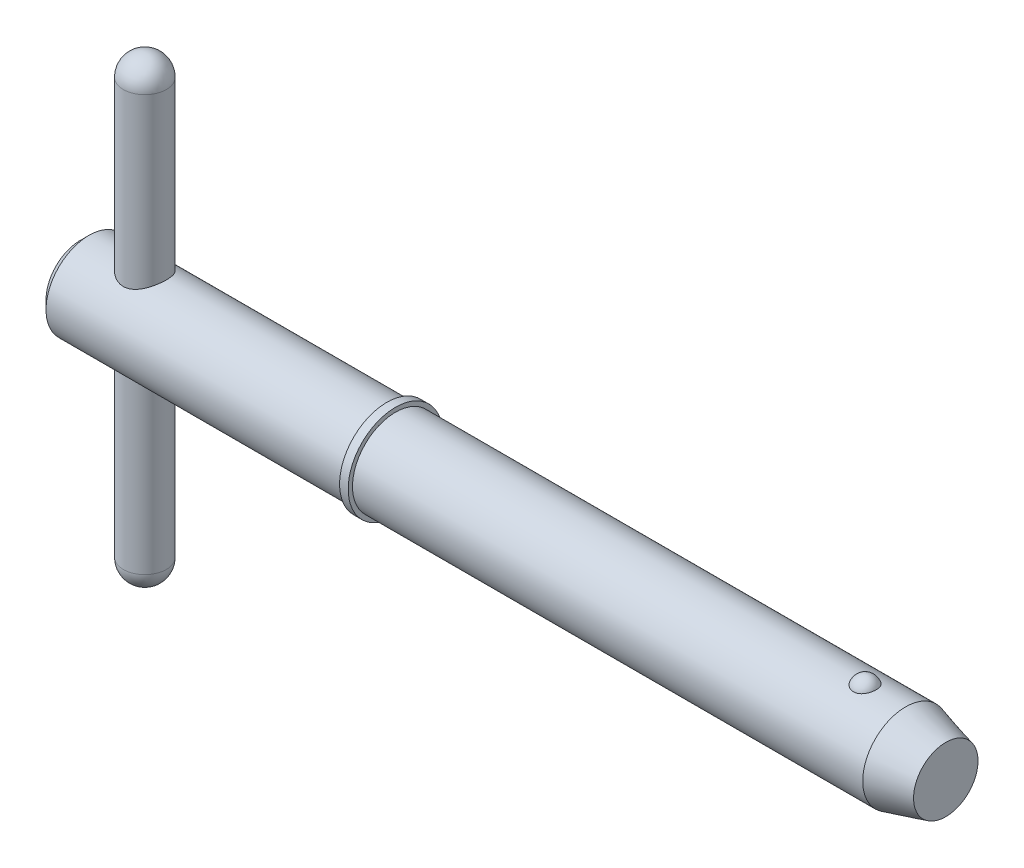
ISO-10303-21;
HEADER;
FILE_DESCRIPTION(('STEP AP214'),'2;1');
FILE_NAME('part.step','',(''),(''),'','','');
FILE_SCHEMA(('AUTOMOTIVE_DESIGN { 1 0 10303 214 1 1 1 1 }'));
ENDSEC;
DATA;
#1=APPLICATION_CONTEXT('core data for automotive mechanical design processes');
#2=APPLICATION_PROTOCOL_DEFINITION('international standard','automotive_design',2000,#1);
#3=PRODUCT_CONTEXT('',#1,'mechanical');
#4=PRODUCT('Part','Part','',(#3));
#5=PRODUCT_RELATED_PRODUCT_CATEGORY('part','',(#4));
#6=PRODUCT_DEFINITION_FORMATION('','',#4);
#7=PRODUCT_DEFINITION_CONTEXT('part definition',#1,'design');
#8=PRODUCT_DEFINITION('design','',#6,#7);
#9=PRODUCT_DEFINITION_SHAPE('','',#8);
#10=(LENGTH_UNIT() NAMED_UNIT(*) SI_UNIT(.MILLI.,.METRE.));
#11=(NAMED_UNIT(*) PLANE_ANGLE_UNIT() SI_UNIT($,.RADIAN.));
#12=(NAMED_UNIT(*) SI_UNIT($,.STERADIAN.) SOLID_ANGLE_UNIT());
#13=UNCERTAINTY_MEASURE_WITH_UNIT(LENGTH_MEASURE(1.E-05),#10,'distance_accuracy_value','');
#14=(GEOMETRIC_REPRESENTATION_CONTEXT(3) GLOBAL_UNCERTAINTY_ASSIGNED_CONTEXT((#13)) GLOBAL_UNIT_ASSIGNED_CONTEXT((#10,
#11,#12)) REPRESENTATION_CONTEXT('',''));
#15=CARTESIAN_POINT('',(0.,0.,0.));
#16=DIRECTION('',(0.,0.,1.));
#17=DIRECTION('',(1.,0.,0.));
#18=AXIS2_PLACEMENT_3D('',#15,#16,#17);
#19=CARTESIAN_POINT('',(3.57,12.7,0.));
#20=DIRECTION('',(0.,-1.,0.));
#21=DIRECTION('',(0.,0.,-1.));
#22=AXIS2_PLACEMENT_3D('',#19,#20,#21);
#23=CYLINDRICAL_SURFACE('',#22,1.19);
#24=CARTESIAN_POINT('',(3.57,-11.51,0.));
#25=DIRECTION('',(0.,-1.,0.));
#26=DIRECTION('',(0.,0.,-1.));
#27=AXIS2_PLACEMENT_3D('',#24,#25,#26);
#28=CIRCLE('',#27,1.19);
#29=CARTESIAN_POINT('',(3.57,-11.51,-1.19));
#30=VERTEX_POINT('',#29);
#31=EDGE_CURVE('P0_E10',#30,#30,#28,.F.);
#32=ORIENTED_EDGE('',*,*,#31,.T.);
#33=EDGE_LOOP('',(#32));
#34=FACE_BOUND('',#33,.T.);
#35=CARTESIAN_POINT('',(3.57,11.51,0.));
#36=DIRECTION('',(0.,-1.,0.));
#37=DIRECTION('',(0.,0.,-1.));
#38=AXIS2_PLACEMENT_3D('',#35,#36,#37);
#39=CIRCLE('',#38,1.19);
#40=CARTESIAN_POINT('',(3.57,11.51,-1.19));
#41=VERTEX_POINT('',#40);
#42=EDGE_CURVE('P0_E21',#41,#41,#39,.T.);
#43=ORIENTED_EDGE('',*,*,#42,.T.);
#44=EDGE_LOOP('',(#43));
#45=FACE_BOUND('',#44,.T.);
#46=ADVANCED_FACE('P0_F14',(#34,#45),#23,.T.);
#47=CARTESIAN_POINT('',(3.57,-11.51,0.));
#48=DIRECTION('',(0.,0.,1.));
#49=DIRECTION('',(1.,0.,0.));
#50=AXIS2_PLACEMENT_3D('',#47,#48,#49);
#51=SPHERICAL_SURFACE('',#50,1.19);
#52=CARTESIAN_POINT('',(3.57,-11.51,0.));
#53=DIRECTION('',(0.,-1.,0.));
#54=DIRECTION('',(0.,0.,-1.));
#55=AXIS2_PLACEMENT_3D('',#52,#53,#54);
#56=SPHERICAL_SURFACE('',#55,1.19);
#57=ORIENTED_EDGE('',*,*,#31,.F.);
#58=EDGE_LOOP('',(#57));
#59=FACE_BOUND('',#58,.T.);
#60=ADVANCED_FACE('P0_F29',(#59),#56,.T.);
#61=CARTESIAN_POINT('',(3.57,11.51,0.));
#62=DIRECTION('',(0.,0.,1.));
#63=DIRECTION('',(1.,0.,0.));
#64=AXIS2_PLACEMENT_3D('',#61,#62,#63);
#65=SPHERICAL_SURFACE('',#64,1.19);
#66=CARTESIAN_POINT('',(3.57,11.51,0.));
#67=DIRECTION('',(0.,-1.,0.));
#68=DIRECTION('',(0.,0.,-1.));
#69=AXIS2_PLACEMENT_3D('',#66,#67,#68);
#70=SPHERICAL_SURFACE('',#69,1.19);
#71=ORIENTED_EDGE('',*,*,#42,.F.);
#72=EDGE_LOOP('',(#71));
#73=FACE_BOUND('',#72,.T.);
#74=ADVANCED_FACE('P0_F16',(#73),#70,.T.);
#75=CLOSED_SHELL('',(#46,#60,#74));
#76=MANIFOLD_SOLID_BREP('P0_B1',#75);
#77=CARTESIAN_POINT('',(0.,0.,0.));
#78=DIRECTION('',(1.,0.,0.));
#79=DIRECTION('',(0.,0.,-1.));
#80=AXIS2_PLACEMENT_3D('',#77,#78,#79);
#81=CYLINDRICAL_SURFACE('',#80,2.38);
#82=CARTESIAN_POINT('',(45.7094297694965,0.,0.));
#83=DIRECTION('',(1.,0.,0.));
#84=DIRECTION('',(0.,0.,-1.));
#85=AXIS2_PLACEMENT_3D('',#82,#83,#84);
#86=CIRCLE('',#85,2.38);
#87=CARTESIAN_POINT('',(45.7094297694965,0.,-2.38));
#88=VERTEX_POINT('',#87);
#89=EDGE_CURVE('P1_E81',#88,#88,#86,.T.);
#90=ORIENTED_EDGE('',*,*,#89,.F.);
#91=EDGE_LOOP('',(#90));
#92=FACE_BOUND('',#91,.T.);
#93=CARTESIAN_POINT('',(17.45,0.,0.));
#94=DIRECTION('',(1.,0.,0.));
#95=DIRECTION('',(0.,0.,-1.));
#96=AXIS2_PLACEMENT_3D('',#93,#94,#95);
#97=CIRCLE('',#96,2.38);
#98=CARTESIAN_POINT('',(17.45,0.,-2.38));
#99=VERTEX_POINT('',#98);
#100=EDGE_CURVE('P1_E85',#99,#99,#97,.T.);
#101=ORIENTED_EDGE('',*,*,#100,.T.);
#102=EDGE_LOOP('',(#101));
#103=FACE_BOUND('',#102,.T.);
#104=CARTESIAN_POINT('',(43.4634492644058,2.2921568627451,0.640637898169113));
#105=CARTESIAN_POINT('',(43.4303559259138,2.29215737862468,0.640637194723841));
#106=CARTESIAN_POINT('',(43.3972546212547,2.29293179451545,0.637884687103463));
#107=CARTESIAN_POINT('',(43.3320176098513,2.29594030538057,0.626968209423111));
#108=CARTESIAN_POINT('',(43.2998823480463,2.29817506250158,0.61880178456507));
#109=CARTESIAN_POINT('',(43.2375402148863,2.3038430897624,0.597351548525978));
#110=CARTESIAN_POINT('',(43.2073305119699,2.30727454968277,0.584075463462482));
#111=CARTESIAN_POINT('',(43.1495674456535,2.31495941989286,0.552829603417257));
#112=CARTESIAN_POINT('',(43.1220141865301,2.31921286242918,0.534859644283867));
#113=CARTESIAN_POINT('',(43.0695938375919,2.32820213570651,0.494282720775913));
#114=CARTESIAN_POINT('',(43.0448050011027,2.33294694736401,0.471576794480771));
#115=CARTESIAN_POINT('',(42.9992169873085,2.34234144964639,0.422446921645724));
#116=CARTESIAN_POINT('',(42.9784185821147,2.34699112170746,0.396022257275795));
#117=CARTESIAN_POINT('',(42.9403580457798,2.35593942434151,0.338855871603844));
#118=CARTESIAN_POINT('',(42.9233051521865,2.36021170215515,0.307970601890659));
#119=CARTESIAN_POINT('',(42.8943607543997,2.3677057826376,0.243750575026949));
#120=CARTESIAN_POINT('',(42.8824701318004,2.37092740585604,0.210415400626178));
#121=CARTESIAN_POINT('',(42.8638076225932,2.37606901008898,0.1411894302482));
#122=CARTESIAN_POINT('',(42.8571956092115,2.37794816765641,0.10525240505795));
#123=CARTESIAN_POINT('',(42.8498095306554,2.38005135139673,0.032735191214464));
#124=CARTESIAN_POINT('',(42.8490358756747,2.38027526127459,-0.0038450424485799));
#125=CARTESIAN_POINT('',(42.8533628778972,2.37903842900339,-0.0769838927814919));
#126=CARTESIAN_POINT('',(42.8585202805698,2.37756141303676,-0.1135388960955));
#127=CARTESIAN_POINT('',(42.8747013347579,2.37305303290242,-0.185229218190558));
#128=CARTESIAN_POINT('',(42.8857251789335,2.37002161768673,-0.220364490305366));
#129=CARTESIAN_POINT('',(42.9133977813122,2.36273722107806,-0.28815667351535));
#130=CARTESIAN_POINT('',(42.9300389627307,2.35848588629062,-0.320816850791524));
#131=CARTESIAN_POINT('',(42.9685984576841,2.34923130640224,-0.382744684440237));
#132=CARTESIAN_POINT('',(42.990516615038,2.34422808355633,-0.412012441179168));
#133=CARTESIAN_POINT('',(43.0387549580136,2.33412555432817,-0.465830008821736));
#134=CARTESIAN_POINT('',(43.065002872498,2.32902887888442,-0.490444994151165));
#135=CARTESIAN_POINT('',(43.1214769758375,2.31926941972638,-0.534700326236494));
#136=CARTESIAN_POINT('',(43.151702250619,2.3146065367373,-0.554341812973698));
#137=CARTESIAN_POINT('',(43.2140618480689,2.30645675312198,-0.587312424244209));
#138=CARTESIAN_POINT('',(43.2460780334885,2.30293152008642,-0.600855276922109));
#139=CARTESIAN_POINT('',(43.3120795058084,2.29725171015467,-0.622220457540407));
#140=CARTESIAN_POINT('',(43.3460641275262,2.29509667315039,-0.630044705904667));
#141=CARTESIAN_POINT('',(43.413299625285,2.29249264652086,-0.639452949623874));
#142=CARTESIAN_POINT('',(43.4465087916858,2.29196755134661,-0.641315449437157));
#143=CARTESIAN_POINT('',(43.512763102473,2.29246849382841,-0.639522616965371));
#144=CARTESIAN_POINT('',(43.5458082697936,2.29349430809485,-0.635868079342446));
#145=CARTESIAN_POINT('',(43.6101025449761,2.29694059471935,-0.623301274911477));
#146=CARTESIAN_POINT('',(43.6413744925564,2.29933234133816,-0.614497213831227));
#147=CARTESIAN_POINT('',(43.7019952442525,2.30522511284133,-0.592006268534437));
#148=CARTESIAN_POINT('',(43.7313438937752,2.30872622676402,-0.578318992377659));
#149=CARTESIAN_POINT('',(43.7880369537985,2.31655795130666,-0.546112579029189));
#150=CARTESIAN_POINT('',(43.815320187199,2.32090569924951,-0.527490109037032));
#151=CARTESIAN_POINT('',(43.8664904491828,2.3299220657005,-0.486117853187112));
#152=CARTESIAN_POINT('',(43.8903767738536,2.33459075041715,-0.46336721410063));
#153=CARTESIAN_POINT('',(43.9352722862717,2.34399834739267,-0.413220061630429));
#154=CARTESIAN_POINT('',(43.9560972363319,2.34873051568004,-0.385657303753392));
#155=CARTESIAN_POINT('',(43.993056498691,2.35754932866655,-0.327455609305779));
#156=CARTESIAN_POINT('',(44.0091898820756,2.36163584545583,-0.296816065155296));
#157=CARTESIAN_POINT('',(44.0369822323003,2.36889321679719,-0.232047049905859));
#158=CARTESIAN_POINT('',(44.0484450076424,2.37202275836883,-0.197828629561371));
#159=CARTESIAN_POINT('',(44.0657523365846,2.37681926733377,-0.127900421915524));
#160=CARTESIAN_POINT('',(44.0715962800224,2.37848607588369,-0.0921904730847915));
#161=CARTESIAN_POINT('',(44.077605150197,2.38020024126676,-0.0196348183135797));
#162=CARTESIAN_POINT('',(44.0776704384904,2.38021918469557,0.0172198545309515));
#163=CARTESIAN_POINT('',(44.0718689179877,2.37856356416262,0.0904219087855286));
#164=CARTESIAN_POINT('',(44.0660018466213,2.37688892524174,0.126769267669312));
#165=CARTESIAN_POINT('',(44.048425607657,2.37201688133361,0.19802859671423));
#166=CARTESIAN_POINT('',(44.0366998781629,2.36881516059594,0.232936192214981));
#167=CARTESIAN_POINT('',(44.0076354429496,2.36123444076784,0.300196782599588));
#168=CARTESIAN_POINT('',(43.9902967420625,2.3568554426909,0.332549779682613));
#169=CARTESIAN_POINT('',(43.9505350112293,2.34744667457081,0.39349541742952));
#170=CARTESIAN_POINT('',(43.9281528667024,2.34242227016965,0.422115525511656));
#171=CARTESIAN_POINT('',(43.8787391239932,2.33227293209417,0.475004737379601));
#172=CARTESIAN_POINT('',(43.8517076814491,2.32714800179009,0.499273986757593));
#173=CARTESIAN_POINT('',(43.7944988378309,2.31755359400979,0.542046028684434));
#174=CARTESIAN_POINT('',(43.7644297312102,2.3130698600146,0.560690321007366));
#175=CARTESIAN_POINT('',(43.7013869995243,2.30514125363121,0.592447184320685));
#176=CARTESIAN_POINT('',(43.6684158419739,2.30169550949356,0.605564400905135));
#177=CARTESIAN_POINT('',(43.6068424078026,2.29677744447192,0.623927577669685));
#178=CARTESIAN_POINT('',(43.5785555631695,2.295058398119,0.630178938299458));
#179=CARTESIAN_POINT('',(43.5213308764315,2.29274795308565,0.638534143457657));
#180=CARTESIAN_POINT('',(43.4923931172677,2.29215641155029,0.640638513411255));
#181=CARTESIAN_POINT('',(43.4634492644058,2.2921568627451,0.640637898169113));
#182=B_SPLINE_CURVE_WITH_KNOTS('',3,(#104,#105,#106,#107,#108,#109,#110,#111,#112,#113,#114,
#115,#116,#117,#118,#119,#120,#121,#122,#123,#124,#125,#126,#127,#128,#129,#130,#131,#132,#133,
#134,#135,#136,#137,#138,#139,#140,#141,#142,#143,#144,#145,#146,#147,#148,#149,#150,#151,#152,
#153,#154,#155,#156,#157,#158,#159,#160,#161,#162,#163,#164,#165,#166,#167,#168,#169,#170,#171,
#172,#173,#174,#175,#176,#177,#178,#179,#180,#181),.UNSPECIFIED.,.T.,.F.,(4,2,2,2,2,2,2,2,2,2,2,
2,2,2,2,2,2,2,2,2,2,2,2,2,2,2,2,2,2,2,2,2,2,2,2,2,2,2,4),(0.,0.0991724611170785,
0.198389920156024,0.29745794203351,0.396529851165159,0.497927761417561,0.599345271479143,
0.705475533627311,0.811623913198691,0.920876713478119,1.03013718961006,1.14045177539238,
1.25076998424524,1.36093998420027,1.47110672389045,1.57959248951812,1.68805336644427,
1.79234266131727,1.89659691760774,1.99590391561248,2.09519661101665,2.19247425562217,
2.28975970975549,2.38926978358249,2.48880044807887,2.59293588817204,2.69709193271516,
2.80525821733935,2.91343624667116,3.02347917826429,3.13352698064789,3.24388765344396,
3.35424823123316,3.46374443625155,3.5732369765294,3.67968690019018,3.78604717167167,
3.87279565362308,3.9595331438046),.UNSPECIFIED.);
#183=CARTESIAN_POINT('',(43.4634492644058,2.2921568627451,0.640637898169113));
#184=VERTEX_POINT('',#183);
#185=EDGE_CURVE('P1_E35',#184,#184,#182,.T.);
#186=ORIENTED_EDGE('',*,*,#185,.T.);
#187=EDGE_LOOP('',(#186));
#188=FACE_BOUND('',#187,.T.);
#189=ADVANCED_FACE('P1_F13',(#92,#103,#188),#81,.T.);
#190=CARTESIAN_POINT('',(0.,0.,0.));
#191=DIRECTION('',(-1.,0.,0.));
#192=DIRECTION('',(0.,0.,1.));
#193=AXIS2_PLACEMENT_3D('',#190,#191,#192);
#194=PLANE('',#193);
#195=CARTESIAN_POINT('',(0.,0.,0.));
#196=DIRECTION('',(1.,0.,0.));
#197=DIRECTION('',(0.,0.,-1.));
#198=AXIS2_PLACEMENT_3D('',#195,#196,#197);
#199=CIRCLE('',#198,1.904);
#200=CARTESIAN_POINT('',(0.,0.,-1.904));
#201=VERTEX_POINT('',#200);
#202=EDGE_CURVE('P1_E9',#201,#201,#199,.T.);
#203=ORIENTED_EDGE('',*,*,#202,.F.);
#204=EDGE_LOOP('',(#203));
#205=FACE_BOUND('',#204,.T.);
#206=ADVANCED_FACE('P1_F15',(#205),#194,.T.);
#207=CARTESIAN_POINT('',(0.475999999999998,0.,0.));
#208=DIRECTION('',(1.,0.,0.));
#209=DIRECTION('',(0.,0.,-1.));
#210=AXIS2_PLACEMENT_3D('',#207,#208,#209);
#211=CONICAL_SURFACE('',#210,2.38,0.78539816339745);
#212=ORIENTED_EDGE('',*,*,#202,.T.);
#213=EDGE_LOOP('',(#212));
#214=FACE_BOUND('',#213,.T.);
#215=CARTESIAN_POINT('',(0.475999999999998,0.,0.));
#216=DIRECTION('',(1.,0.,0.));
#217=DIRECTION('',(0.,0.,-1.));
#218=AXIS2_PLACEMENT_3D('',#215,#216,#217);
#219=CIRCLE('',#218,2.38);
#220=CARTESIAN_POINT('',(0.475999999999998,0.,-2.38));
#221=VERTEX_POINT('',#220);
#222=EDGE_CURVE('P1_E26',#221,#221,#219,.T.);
#223=ORIENTED_EDGE('',*,*,#222,.F.);
#224=EDGE_LOOP('',(#223));
#225=FACE_BOUND('',#224,.T.);
#226=ADVANCED_FACE('P1_F77',(#214,#225),#211,.T.);
#227=CARTESIAN_POINT('',(0.,0.,0.));
#228=DIRECTION('',(1.,0.,0.));
#229=DIRECTION('',(0.,0.,-1.));
#230=AXIS2_PLACEMENT_3D('',#227,#228,#229);
#231=CYLINDRICAL_SURFACE('',#230,2.38);
#232=CARTESIAN_POINT('',(3.57,-2.06114046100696,1.19));
#233=CARTESIAN_POINT('',(3.50799170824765,-2.06114586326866,1.18999567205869));
#234=CARTESIAN_POINT('',(3.4459051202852,-2.0639812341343,1.18512096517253));
#235=CARTESIAN_POINT('',(3.32363755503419,-2.07491216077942,1.16587061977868));
#236=CARTESIAN_POINT('',(3.26346086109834,-2.08301876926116,1.15147501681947));
#237=CARTESIAN_POINT('',(3.14701251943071,-2.10331722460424,1.11395893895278));
#238=CARTESIAN_POINT('',(3.09072196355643,-2.1154873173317,1.09088484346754));
#239=CARTESIAN_POINT('',(2.9828251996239,-2.14250771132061,1.03680835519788));
#240=CARTESIAN_POINT('',(2.93121924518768,-2.15735815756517,1.00580553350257));
#241=CARTESIAN_POINT('',(2.82945618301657,-2.18956274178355,0.933753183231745));
#242=CARTESIAN_POINT('',(2.77976962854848,-2.20702235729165,0.892085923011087));
#243=CARTESIAN_POINT('',(2.68772401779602,-2.2416265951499,0.801172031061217));
#244=CARTESIAN_POINT('',(2.64536861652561,-2.25877105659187,0.751921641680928));
#245=CARTESIAN_POINT('',(2.56639309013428,-2.29219557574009,0.64318258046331));
#246=CARTESIAN_POINT('',(2.53035201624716,-2.30833946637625,0.583227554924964));
#247=CARTESIAN_POINT('',(2.46908238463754,-2.3365739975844,0.45714686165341));
#248=CARTESIAN_POINT('',(2.44384700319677,-2.34866719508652,0.391025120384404));
#249=CARTESIAN_POINT('',(2.40676945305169,-2.36667748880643,0.259473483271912));
#250=CARTESIAN_POINT('',(2.39410206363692,-2.37297281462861,0.194329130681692));
#251=CARTESIAN_POINT('',(2.3798023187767,-2.3800902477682,0.0625590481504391));
#252=CARTESIAN_POINT('',(2.37816328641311,-2.38091566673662,-0.00406576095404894));
#253=CARTESIAN_POINT('',(2.38564854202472,-2.37717948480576,-0.130700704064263));
#254=CARTESIAN_POINT('',(2.39384923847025,-2.37308010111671,-0.190782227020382));
#255=CARTESIAN_POINT('',(2.41912820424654,-2.360653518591,-0.308583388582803));
#256=CARTESIAN_POINT('',(2.43620713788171,-2.35232600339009,-0.366302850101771));
#257=CARTESIAN_POINT('',(2.47886825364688,-2.33206184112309,-0.478748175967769));
#258=CARTESIAN_POINT('',(2.50456481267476,-2.32007685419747,-0.533421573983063));
#259=CARTESIAN_POINT('',(2.56357346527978,-2.29357798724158,-0.637812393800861));
#260=CARTESIAN_POINT('',(2.5968882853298,-2.27906320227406,-0.687528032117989));
#261=CARTESIAN_POINT('',(2.67380546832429,-2.24724829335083,-0.785606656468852));
#262=CARTESIAN_POINT('',(2.71808260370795,-2.22981457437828,-0.833397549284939));
#263=CARTESIAN_POINT('',(2.81386177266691,-2.19500665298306,-0.921184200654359));
#264=CARTESIAN_POINT('',(2.86536931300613,-2.17763250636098,-0.961173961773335));
#265=CARTESIAN_POINT('',(2.97815134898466,-2.14371545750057,-1.03471134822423));
#266=CARTESIAN_POINT('',(3.03983836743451,-2.12729540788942,-1.06768860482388));
#267=CARTESIAN_POINT('',(3.16889582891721,-2.09886785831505,-1.12254974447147));
#268=CARTESIAN_POINT('',(3.2362602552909,-2.0868557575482,-1.14444520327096));
#269=CARTESIAN_POINT('',(3.36914526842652,-2.06994116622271,-1.1747444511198));
#270=CARTESIAN_POINT('',(3.43438893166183,-2.06455070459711,-1.18407989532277));
#271=CARTESIAN_POINT('',(3.56571759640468,-2.06010324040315,-1.1918051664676));
#272=CARTESIAN_POINT('',(3.63180197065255,-2.06104176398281,-1.19020272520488));
#273=CARTESIAN_POINT('',(3.75522816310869,-2.06862860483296,-1.17695289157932));
#274=CARTESIAN_POINT('',(3.81273554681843,-2.07464109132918,-1.16642350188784));
#275=CARTESIAN_POINT('',(3.92505766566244,-2.09075885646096,-1.1372785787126));
#276=CARTESIAN_POINT('',(3.97987152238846,-2.1008654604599,-1.1186604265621));
#277=CARTESIAN_POINT('',(4.08813948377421,-2.12458104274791,-1.07296063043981));
#278=CARTESIAN_POINT('',(4.14141303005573,-2.13833055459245,-1.04552693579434));
#279=CARTESIAN_POINT('',(4.2429084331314,-2.16765782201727,-0.983281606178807));
#280=CARTESIAN_POINT('',(4.29112767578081,-2.18323651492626,-0.948466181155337));
#281=CARTESIAN_POINT('',(4.38750473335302,-2.2168271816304,-0.867316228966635));
#282=CARTESIAN_POINT('',(4.43488860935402,-2.23489833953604,-0.82008287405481));
#283=CARTESIAN_POINT('',(4.52130056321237,-2.26973739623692,-0.718051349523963));
#284=CARTESIAN_POINT('',(4.56032581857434,-2.28650485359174,-0.663250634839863));
#285=CARTESIAN_POINT('',(4.62978273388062,-2.31742220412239,-0.545657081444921));
#286=CARTESIAN_POINT('',(4.65996041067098,-2.33149133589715,-0.482691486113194));
#287=CARTESIAN_POINT('',(4.7089941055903,-2.35481192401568,-0.351671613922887));
#288=CARTESIAN_POINT('',(4.7278600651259,-2.36406760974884,-0.283621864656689));
#289=CARTESIAN_POINT('',(4.75210859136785,-2.3760433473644,-0.151105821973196));
#290=CARTESIAN_POINT('',(4.75856947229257,-2.37928514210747,-0.0868836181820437));
#291=CARTESIAN_POINT('',(4.76100348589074,-2.38050135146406,0.0417999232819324));
#292=CARTESIAN_POINT('',(4.75698028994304,-2.37847760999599,0.106261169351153));
#293=CARTESIAN_POINT('',(4.73927447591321,-2.36969422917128,0.229120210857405));
#294=CARTESIAN_POINT('',(4.72624582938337,-2.36325544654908,0.287637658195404));
#295=CARTESIAN_POINT('',(4.69178087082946,-2.34658591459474,0.401560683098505));
#296=CARTESIAN_POINT('',(4.67034335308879,-2.33635462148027,0.456965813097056));
#297=CARTESIAN_POINT('',(4.61871480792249,-2.31247857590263,0.565753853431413));
#298=CARTESIAN_POINT('',(4.58818860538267,-2.29870654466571,0.618948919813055));
#299=CARTESIAN_POINT('',(4.51967006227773,-2.26918878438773,0.719681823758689));
#300=CARTESIAN_POINT('',(4.48167429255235,-2.25344215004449,0.76721704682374));
#301=CARTESIAN_POINT('',(4.39491140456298,-2.21969046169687,0.860267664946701));
#302=CARTESIAN_POINT('',(4.34544863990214,-2.20161660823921,0.905111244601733));
#303=CARTESIAN_POINT('',(4.23943364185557,-2.16655060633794,0.986109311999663));
#304=CARTESIAN_POINT('',(4.18287520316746,-2.1495594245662,1.02225611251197));
#305=CARTESIAN_POINT('',(4.06190239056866,-2.1181953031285,1.08579298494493));
#306=CARTESIAN_POINT('',(3.9972962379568,-2.10392207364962,1.11287022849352));
#307=CARTESIAN_POINT('',(3.86353443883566,-2.08090726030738,1.15534566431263));
#308=CARTESIAN_POINT('',(3.7943948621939,-2.07214719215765,1.17078291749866));
#309=CARTESIAN_POINT('',(3.69875162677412,-2.06499834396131,1.18329673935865));
#310=CARTESIAN_POINT('',(3.67309220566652,-2.06355673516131,1.18580656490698));
#311=CARTESIAN_POINT('',(3.62162638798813,-2.06162663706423,1.18915915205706));
#312=CARTESIAN_POINT('',(3.59581998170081,-2.0611382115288,1.19000180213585));
#313=CARTESIAN_POINT('',(3.57,-2.06114046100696,1.19));
#314=B_SPLINE_CURVE_WITH_KNOTS('',3,(#232,#233,#234,#235,#236,#237,#238,#239,#240,#241,#242,
#243,#244,#245,#246,#247,#248,#249,#250,#251,#252,#253,#254,#255,#256,#257,#258,#259,#260,#261,
#262,#263,#264,#265,#266,#267,#268,#269,#270,#271,#272,#273,#274,#275,#276,#277,#278,#279,#280,
#281,#282,#283,#284,#285,#286,#287,#288,#289,#290,#291,#292,#293,#294,#295,#296,#297,#298,#299,
#300,#301,#302,#303,#304,#305,#306,#307,#308,#309,#310,#311,#312,#313),.UNSPECIFIED.,.T.,.F.,(4,
2,2,2,2,2,2,2,2,2,2,2,2,2,2,2,2,2,2,2,2,2,2,2,2,2,2,2,2,2,2,2,2,2,2,2,2,2,2,2,4),(0.,
0.185916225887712,0.372223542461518,0.557549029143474,0.742884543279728,0.943506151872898,
1.14422749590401,1.35847891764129,1.5725948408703,1.77147547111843,1.97023568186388,
2.15171156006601,2.33320101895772,2.51720146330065,2.70126786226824,2.902733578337,
3.10435357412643,3.31877721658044,3.53297641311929,3.73020126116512,3.92728670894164,
4.1028127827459,4.27839572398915,4.46211082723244,4.64592048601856,4.8529002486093,
5.0599497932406,5.27246375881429,5.48479067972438,5.67763601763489,5.87041383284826,
6.05048865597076,6.23058930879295,6.41839293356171,6.60628297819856,6.8128718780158,
7.01964271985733,7.2329479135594,7.44553408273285,7.52294360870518,7.60035831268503),.UNSPECIFIED.);
#315=CARTESIAN_POINT('',(3.57,-2.06114046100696,1.19));
#316=VERTEX_POINT('',#315);
#317=EDGE_CURVE('P1_E17',#316,#316,#314,.T.);
#318=ORIENTED_EDGE('',*,*,#317,.F.);
#319=EDGE_LOOP('',(#318));
#320=FACE_BOUND('',#319,.T.);
#321=CARTESIAN_POINT('',(3.57,2.06114046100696,1.19));
#322=CARTESIAN_POINT('',(3.63200829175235,2.06114586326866,1.18999567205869));
#323=CARTESIAN_POINT('',(3.6940948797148,2.0639812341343,1.18512096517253));
#324=CARTESIAN_POINT('',(3.81636244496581,2.07491216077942,1.16587061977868));
#325=CARTESIAN_POINT('',(3.87653913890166,2.08301876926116,1.15147501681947));
#326=CARTESIAN_POINT('',(3.99298748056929,2.10331722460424,1.11395893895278));
#327=CARTESIAN_POINT('',(4.04927803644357,2.1154873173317,1.09088484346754));
#328=CARTESIAN_POINT('',(4.1571748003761,2.14250771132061,1.03680835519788));
#329=CARTESIAN_POINT('',(4.20878075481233,2.15735815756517,1.00580553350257));
#330=CARTESIAN_POINT('',(4.31054381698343,2.18956274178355,0.933753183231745));
#331=CARTESIAN_POINT('',(4.36023037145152,2.20702235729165,0.892085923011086));
#332=CARTESIAN_POINT('',(4.45227598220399,2.2416265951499,0.801172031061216));
#333=CARTESIAN_POINT('',(4.49463138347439,2.25877105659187,0.751921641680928));
#334=CARTESIAN_POINT('',(4.57360690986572,2.29219557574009,0.643182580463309));
#335=CARTESIAN_POINT('',(4.60964798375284,2.30833946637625,0.583227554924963));
#336=CARTESIAN_POINT('',(4.67091761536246,2.3365739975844,0.457146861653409));
#337=CARTESIAN_POINT('',(4.69615299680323,2.34866719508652,0.391025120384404));
#338=CARTESIAN_POINT('',(4.73323054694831,2.36667748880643,0.259473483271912));
#339=CARTESIAN_POINT('',(4.74589793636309,2.37297281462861,0.194329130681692));
#340=CARTESIAN_POINT('',(4.7601976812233,2.3800902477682,0.0625590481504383));
#341=CARTESIAN_POINT('',(4.76183671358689,2.38091566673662,-0.00406576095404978));
#342=CARTESIAN_POINT('',(4.75435145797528,2.37717948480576,-0.130700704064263));
#343=CARTESIAN_POINT('',(4.74615076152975,2.37308010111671,-0.190782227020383));
#344=CARTESIAN_POINT('',(4.72087179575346,2.360653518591,-0.308583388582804));
#345=CARTESIAN_POINT('',(4.70379286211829,2.35232600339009,-0.366302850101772));
#346=CARTESIAN_POINT('',(4.66113174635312,2.33206184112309,-0.478748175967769));
#347=CARTESIAN_POINT('',(4.63543518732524,2.32007685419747,-0.533421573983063));
#348=CARTESIAN_POINT('',(4.57642653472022,2.29357798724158,-0.637812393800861));
#349=CARTESIAN_POINT('',(4.5431117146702,2.27906320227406,-0.687528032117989));
#350=CARTESIAN_POINT('',(4.46619453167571,2.24724829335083,-0.785606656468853));
#351=CARTESIAN_POINT('',(4.42191739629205,2.22981457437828,-0.83339754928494));
#352=CARTESIAN_POINT('',(4.32613822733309,2.19500665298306,-0.921184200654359));
#353=CARTESIAN_POINT('',(4.27463068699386,2.17763250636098,-0.961173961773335));
#354=CARTESIAN_POINT('',(4.16184865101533,2.14371545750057,-1.03471134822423));
#355=CARTESIAN_POINT('',(4.10016163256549,2.12729540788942,-1.06768860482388));
#356=CARTESIAN_POINT('',(3.97110417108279,2.09886785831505,-1.12254974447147));
#357=CARTESIAN_POINT('',(3.9037397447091,2.0868557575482,-1.14444520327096));
#358=CARTESIAN_POINT('',(3.77085473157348,2.06994116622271,-1.1747444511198));
#359=CARTESIAN_POINT('',(3.70561106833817,2.06455070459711,-1.18407989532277));
#360=CARTESIAN_POINT('',(3.57428240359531,2.06010324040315,-1.1918051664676));
#361=CARTESIAN_POINT('',(3.50819802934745,2.06104176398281,-1.19020272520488));
#362=CARTESIAN_POINT('',(3.38477183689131,2.06862860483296,-1.17695289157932));
#363=CARTESIAN_POINT('',(3.32726445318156,2.07464109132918,-1.16642350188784));
#364=CARTESIAN_POINT('',(3.21494233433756,2.09075885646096,-1.1372785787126));
#365=CARTESIAN_POINT('',(3.16012847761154,2.1008654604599,-1.1186604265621));
#366=CARTESIAN_POINT('',(3.05186051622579,2.12458104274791,-1.07296063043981));
#367=CARTESIAN_POINT('',(2.99858696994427,2.13833055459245,-1.04552693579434));
#368=CARTESIAN_POINT('',(2.8970915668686,2.16765782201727,-0.983281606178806));
#369=CARTESIAN_POINT('',(2.84887232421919,2.18323651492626,-0.948466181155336));
#370=CARTESIAN_POINT('',(2.75249526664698,2.2168271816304,-0.867316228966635));
#371=CARTESIAN_POINT('',(2.70511139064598,2.23489833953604,-0.820082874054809));
#372=CARTESIAN_POINT('',(2.61869943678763,2.26973739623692,-0.718051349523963));
#373=CARTESIAN_POINT('',(2.57967418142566,2.28650485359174,-0.663250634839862));
#374=CARTESIAN_POINT('',(2.51021726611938,2.31742220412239,-0.54565708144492));
#375=CARTESIAN_POINT('',(2.48003958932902,2.33149133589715,-0.482691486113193));
#376=CARTESIAN_POINT('',(2.4310058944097,2.35481192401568,-0.351671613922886));
#377=CARTESIAN_POINT('',(2.4121399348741,2.36406760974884,-0.283621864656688));
#378=CARTESIAN_POINT('',(2.38789140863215,2.3760433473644,-0.151105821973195));
#379=CARTESIAN_POINT('',(2.38143052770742,2.37928514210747,-0.0868836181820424));
#380=CARTESIAN_POINT('',(2.37899651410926,2.38050135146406,0.0417999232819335));
#381=CARTESIAN_POINT('',(2.38301971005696,2.37847760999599,0.106261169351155));
#382=CARTESIAN_POINT('',(2.40072552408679,2.36969422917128,0.229120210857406));
#383=CARTESIAN_POINT('',(2.41375417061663,2.36325544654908,0.287637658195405));
#384=CARTESIAN_POINT('',(2.44821912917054,2.34658591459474,0.401560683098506));
#385=CARTESIAN_POINT('',(2.46965664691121,2.33635462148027,0.456965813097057));
#386=CARTESIAN_POINT('',(2.52128519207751,2.31247857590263,0.565753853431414));
#387=CARTESIAN_POINT('',(2.55181139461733,2.29870654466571,0.618948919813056));
#388=CARTESIAN_POINT('',(2.62032993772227,2.26918878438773,0.719681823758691));
#389=CARTESIAN_POINT('',(2.65832570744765,2.25344215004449,0.767217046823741));
#390=CARTESIAN_POINT('',(2.74508859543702,2.21969046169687,0.860267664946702));
#391=CARTESIAN_POINT('',(2.79455136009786,2.20161660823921,0.905111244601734));
#392=CARTESIAN_POINT('',(2.90056635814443,2.16655060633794,0.986109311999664));
#393=CARTESIAN_POINT('',(2.95712479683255,2.1495594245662,1.02225611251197));
#394=CARTESIAN_POINT('',(3.07809760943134,2.1181953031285,1.08579298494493));
#395=CARTESIAN_POINT('',(3.1427037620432,2.10392207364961,1.11287022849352));
#396=CARTESIAN_POINT('',(3.27646556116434,2.08090726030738,1.15534566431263));
#397=CARTESIAN_POINT('',(3.3456051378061,2.07214719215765,1.17078291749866));
#398=CARTESIAN_POINT('',(3.44124837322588,2.06499834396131,1.18329673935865));
#399=CARTESIAN_POINT('',(3.46690779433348,2.06355673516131,1.18580656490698));
#400=CARTESIAN_POINT('',(3.51837361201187,2.06162663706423,1.18915915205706));
#401=CARTESIAN_POINT('',(3.54418001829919,2.0611382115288,1.19000180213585));
#402=CARTESIAN_POINT('',(3.57,2.06114046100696,1.19));
#403=B_SPLINE_CURVE_WITH_KNOTS('',3,(#321,#322,#323,#324,#325,#326,#327,#328,#329,#330,#331,
#332,#333,#334,#335,#336,#337,#338,#339,#340,#341,#342,#343,#344,#345,#346,#347,#348,#349,#350,
#351,#352,#353,#354,#355,#356,#357,#358,#359,#360,#361,#362,#363,#364,#365,#366,#367,#368,#369,
#370,#371,#372,#373,#374,#375,#376,#377,#378,#379,#380,#381,#382,#383,#384,#385,#386,#387,#388,
#389,#390,#391,#392,#393,#394,#395,#396,#397,#398,#399,#400,#401,#402),.UNSPECIFIED.,.T.,.F.,(4,
2,2,2,2,2,2,2,2,2,2,2,2,2,2,2,2,2,2,2,2,2,2,2,2,2,2,2,2,2,2,2,2,2,2,2,2,2,2,2,4),(0.,
0.185916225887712,0.372223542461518,0.557549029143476,0.74288454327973,0.9435061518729,
1.14422749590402,1.35847891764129,1.5725948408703,1.77147547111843,1.97023568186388,
2.15171156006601,2.33320101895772,2.51720146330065,2.70126786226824,2.902733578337,
3.10435357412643,3.31877721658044,3.53297641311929,3.73020126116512,3.92728670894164,
4.1028127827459,4.27839572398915,4.46211082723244,4.64592048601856,4.8529002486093,
5.05994979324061,5.27246375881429,5.48479067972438,5.67763601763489,5.87041383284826,
6.05048865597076,6.23058930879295,6.41839293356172,6.60628297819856,6.8128718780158,
7.01964271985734,7.2329479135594,7.44553408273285,7.52294360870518,7.60035831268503),.UNSPECIFIED.);
#404=CARTESIAN_POINT('',(3.57,2.06114046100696,1.19));
#405=VERTEX_POINT('',#404);
#406=EDGE_CURVE('P1_E43',#405,#405,#403,.T.);
#407=ORIENTED_EDGE('',*,*,#406,.F.);
#408=EDGE_LOOP('',(#407));
#409=FACE_BOUND('',#408,.T.);
#410=ORIENTED_EDGE('',*,*,#222,.T.);
#411=EDGE_LOOP('',(#410));
#412=FACE_BOUND('',#411,.T.);
#413=CARTESIAN_POINT('',(16.974,0.,0.));
#414=DIRECTION('',(1.,0.,0.));
#415=DIRECTION('',(0.,0.,-1.));
#416=AXIS2_PLACEMENT_3D('',#413,#414,#415);
#417=CIRCLE('',#416,2.38);
#418=CARTESIAN_POINT('',(16.974,0.,-2.38));
#419=VERTEX_POINT('',#418);
#420=EDGE_CURVE('P1_E31',#419,#419,#417,.T.);
#421=ORIENTED_EDGE('',*,*,#420,.F.);
#422=EDGE_LOOP('',(#421));
#423=FACE_BOUND('',#422,.T.);
#424=ADVANCED_FACE('P1_F103',(#320,#409,#412,#423),#231,.T.);
#425=CARTESIAN_POINT('',(16.974,2.38,0.));
#426=DIRECTION('',(-1.,0.,0.));
#427=DIRECTION('',(0.,0.,1.));
#428=AXIS2_PLACEMENT_3D('',#425,#426,#427);
#429=PLANE('',#428);
#430=ORIENTED_EDGE('',*,*,#420,.T.);
#431=EDGE_LOOP('',(#430));
#432=FACE_BOUND('',#431,.T.);
#433=CARTESIAN_POINT('',(16.974,0.,0.));
#434=DIRECTION('',(1.,0.,0.));
#435=DIRECTION('',(0.,0.,-1.));
#436=AXIS2_PLACEMENT_3D('',#433,#434,#435);
#437=CIRCLE('',#436,2.618);
#438=CARTESIAN_POINT('',(16.974,0.,-2.618));
#439=VERTEX_POINT('',#438);
#440=EDGE_CURVE('P1_E91',#439,#439,#437,.T.);
#441=ORIENTED_EDGE('',*,*,#440,.F.);
#442=EDGE_LOOP('',(#441));
#443=FACE_BOUND('',#442,.T.);
#444=ADVANCED_FACE('P1_F100',(#432,#443),#429,.T.);
#445=CARTESIAN_POINT('',(0.,0.,0.));
#446=DIRECTION('',(1.,0.,0.));
#447=DIRECTION('',(0.,0.,-1.));
#448=AXIS2_PLACEMENT_3D('',#445,#446,#447);
#449=CYLINDRICAL_SURFACE('',#448,2.618);
#450=ORIENTED_EDGE('',*,*,#440,.T.);
#451=EDGE_LOOP('',(#450));
#452=FACE_BOUND('',#451,.T.);
#453=CARTESIAN_POINT('',(17.45,0.,0.));
#454=DIRECTION('',(1.,0.,0.));
#455=DIRECTION('',(0.,0.,-1.));
#456=AXIS2_PLACEMENT_3D('',#453,#454,#455);
#457=CIRCLE('',#456,2.618);
#458=CARTESIAN_POINT('',(17.45,0.,-2.618));
#459=VERTEX_POINT('',#458);
#460=EDGE_CURVE('P1_E88',#459,#459,#457,.T.);
#461=ORIENTED_EDGE('',*,*,#460,.F.);
#462=EDGE_LOOP('',(#461));
#463=FACE_BOUND('',#462,.T.);
#464=ADVANCED_FACE('P1_F68',(#452,#463),#449,.T.);
#465=CARTESIAN_POINT('',(17.45,2.618,0.));
#466=DIRECTION('',(1.,0.,0.));
#467=DIRECTION('',(0.,0.,-1.));
#468=AXIS2_PLACEMENT_3D('',#465,#466,#467);
#469=PLANE('',#468);
#470=ORIENTED_EDGE('',*,*,#460,.T.);
#471=EDGE_LOOP('',(#470));
#472=FACE_BOUND('',#471,.T.);
#473=ORIENTED_EDGE('',*,*,#100,.F.);
#474=EDGE_LOOP('',(#473));
#475=FACE_BOUND('',#474,.T.);
#476=ADVANCED_FACE('P1_F62',(#472,#475),#469,.T.);
#477=CARTESIAN_POINT('',(47.93,0.,0.));
#478=DIRECTION('',(-1.,0.,0.));
#479=DIRECTION('',(0.,0.,1.));
#480=AXIS2_PLACEMENT_3D('',#477,#478,#479);
#481=CONICAL_SURFACE('',#480,1.78500000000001,0.26179938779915);
#482=ORIENTED_EDGE('',*,*,#89,.T.);
#483=EDGE_LOOP('',(#482));
#484=FACE_BOUND('',#483,.T.);
#485=CARTESIAN_POINT('',(47.93,0.,0.));
#486=DIRECTION('',(1.,0.,0.));
#487=DIRECTION('',(0.,0.,-1.));
#488=AXIS2_PLACEMENT_3D('',#485,#486,#487);
#489=CIRCLE('',#488,1.78500000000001);
#490=CARTESIAN_POINT('',(47.93,0.,-1.78500000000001));
#491=VERTEX_POINT('',#490);
#492=EDGE_CURVE('P1_E42',#491,#491,#489,.T.);
#493=ORIENTED_EDGE('',*,*,#492,.F.);
#494=EDGE_LOOP('',(#493));
#495=FACE_BOUND('',#494,.T.);
#496=ADVANCED_FACE('P1_F59',(#484,#495),#481,.T.);
#497=CARTESIAN_POINT('',(47.93,1.78500000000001,0.));
#498=DIRECTION('',(1.,0.,0.));
#499=DIRECTION('',(0.,0.,-1.));
#500=AXIS2_PLACEMENT_3D('',#497,#498,#499);
#501=PLANE('',#500);
#502=ORIENTED_EDGE('',*,*,#492,.T.);
#503=EDGE_LOOP('',(#502));
#504=FACE_BOUND('',#503,.T.);
#505=ADVANCED_FACE('P1_F55',(#504),#501,.T.);
#506=CARTESIAN_POINT('',(43.4634492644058,2.142,0.));
#507=DIRECTION('',(-1.,0.,0.));
#508=DIRECTION('',(0.,1.,0.));
#509=AXIS2_PLACEMENT_3D('',#506,#507,#508);
#510=SPHERICAL_SURFACE('',#509,0.657999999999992);
#511=ORIENTED_EDGE('',*,*,#185,.F.);
#512=EDGE_LOOP('',(#511));
#513=FACE_BOUND('',#512,.T.);
#514=ADVANCED_FACE('P1_F50',(#513),#510,.T.);
#515=CARTESIAN_POINT('',(3.57,-2.618,0.));
#516=DIRECTION('',(0.,1.,0.));
#517=DIRECTION('',(0.,0.,1.));
#518=AXIS2_PLACEMENT_3D('',#515,#516,#517);
#519=CYLINDRICAL_SURFACE('',#518,1.19);
#520=ORIENTED_EDGE('',*,*,#317,.T.);
#521=EDGE_LOOP('',(#520));
#522=FACE_BOUND('',#521,.T.);
#523=ORIENTED_EDGE('',*,*,#406,.T.);
#524=EDGE_LOOP('',(#523));
#525=FACE_BOUND('',#524,.T.);
#526=ADVANCED_FACE('P1_F54',(#522,#525),#519,.F.);
#527=CLOSED_SHELL('',(#189,#206,#226,#424,#444,#464,#476,#496,#505,#514,#526));
#528=MANIFOLD_SOLID_BREP('P1_B1',#527);
#529=ADVANCED_BREP_SHAPE_REPRESENTATION('',(#18,#76,#528),#14);
#530=SHAPE_DEFINITION_REPRESENTATION(#9,#529);
ENDSEC;
END-ISO-10303-21;
